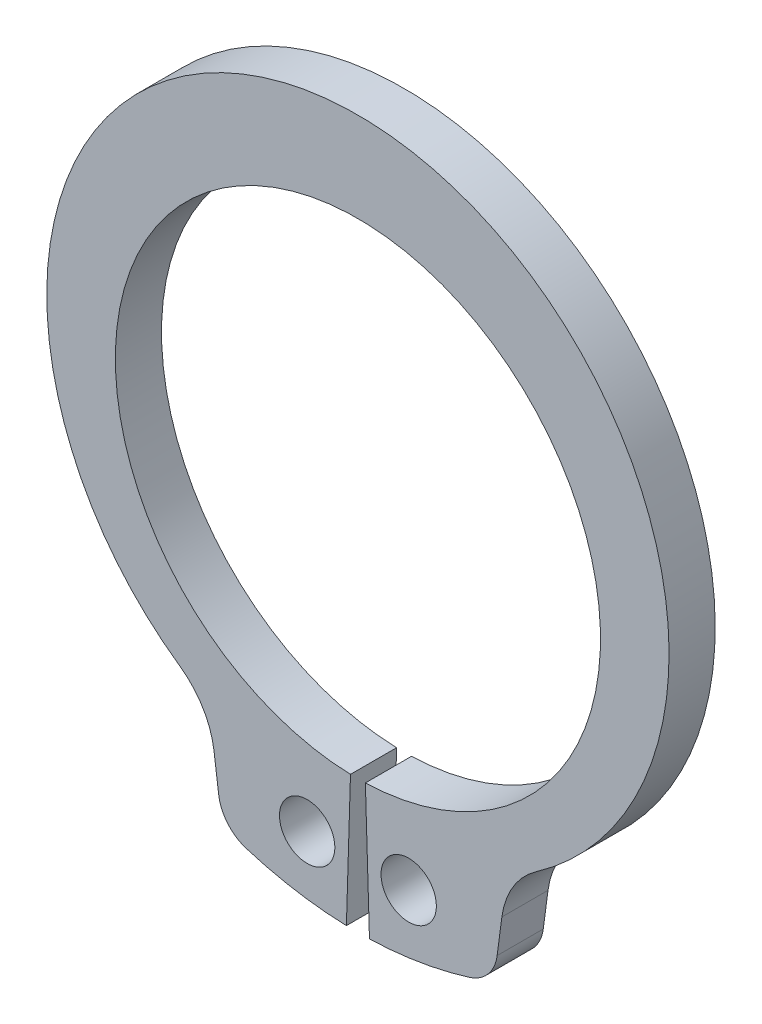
ISO-10303-21;
HEADER;
FILE_DESCRIPTION(('STEP AP214'),'2;1');
FILE_NAME('part.step','',(''),(''),'','','');
FILE_SCHEMA(('AUTOMOTIVE_DESIGN { 1 0 10303 214 1 1 1 1 }'));
ENDSEC;
DATA;
#1=APPLICATION_CONTEXT('core data for automotive mechanical design processes');
#2=APPLICATION_PROTOCOL_DEFINITION('international standard','automotive_design',2000,#1);
#3=PRODUCT_CONTEXT('',#1,'mechanical');
#4=PRODUCT('Part','Part','',(#3));
#5=PRODUCT_RELATED_PRODUCT_CATEGORY('part','',(#4));
#6=PRODUCT_DEFINITION_FORMATION('','',#4);
#7=PRODUCT_DEFINITION_CONTEXT('part definition',#1,'design');
#8=PRODUCT_DEFINITION('design','',#6,#7);
#9=PRODUCT_DEFINITION_SHAPE('','',#8);
#10=(LENGTH_UNIT() NAMED_UNIT(*) SI_UNIT(.MILLI.,.METRE.));
#11=(NAMED_UNIT(*) PLANE_ANGLE_UNIT() SI_UNIT($,.RADIAN.));
#12=(NAMED_UNIT(*) SI_UNIT($,.STERADIAN.) SOLID_ANGLE_UNIT());
#13=UNCERTAINTY_MEASURE_WITH_UNIT(LENGTH_MEASURE(1.E-05),#10,'distance_accuracy_value','');
#14=(GEOMETRIC_REPRESENTATION_CONTEXT(3) GLOBAL_UNCERTAINTY_ASSIGNED_CONTEXT((#13)) GLOBAL_UNIT_ASSIGNED_CONTEXT((#10,
#11,#12)) REPRESENTATION_CONTEXT('',''));
#15=CARTESIAN_POINT('',(0.,0.,0.));
#16=DIRECTION('',(0.,0.,1.));
#17=DIRECTION('',(1.,0.,0.));
#18=AXIS2_PLACEMENT_3D('',#15,#16,#17);
#19=CARTESIAN_POINT('',(0.,0.,-0.889));
#20=DIRECTION('',(0.,0.,1.));
#21=DIRECTION('',(1.,0.,0.));
#22=AXIS2_PLACEMENT_3D('',#19,#20,#21);
#23=CYLINDRICAL_SURFACE('',#22,4.6736);
#24=CARTESIAN_POINT('',(0.,0.,0.));
#25=DIRECTION('',(0.,0.,-1.));
#26=DIRECTION('',(1.,0.,0.));
#27=AXIS2_PLACEMENT_3D('',#24,#25,#26);
#28=CIRCLE('',#27,4.6736);
#29=CARTESIAN_POINT('',(-0.143487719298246,-4.67139681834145,0.));
#30=VERTEX_POINT('',#29);
#31=CARTESIAN_POINT('',(0.143487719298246,-4.67139681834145,0.));
#32=VERTEX_POINT('',#31);
#33=EDGE_CURVE('E159',#30,#32,#28,.T.);
#34=ORIENTED_EDGE('',*,*,#33,.F.);
#35=DIRECTION('',(0.,0.,1.));
#36=VECTOR('',#35,1.);
#37=CARTESIAN_POINT('',(-0.143487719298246,-4.67139681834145,-0.889));
#38=LINE('',#37,#36);
#39=CARTESIAN_POINT('',(-0.143487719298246,-4.67139681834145,-0.889));
#40=VERTEX_POINT('',#39);
#41=EDGE_CURVE('E11',#40,#30,#38,.T.);
#42=ORIENTED_EDGE('',*,*,#41,.F.);
#43=CARTESIAN_POINT('',(0.,0.,-0.889));
#44=DIRECTION('',(0.,0.,-1.));
#45=DIRECTION('',(1.,0.,0.));
#46=AXIS2_PLACEMENT_3D('',#43,#44,#45);
#47=CIRCLE('',#46,4.6736);
#48=CARTESIAN_POINT('',(0.143487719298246,-4.67139681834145,-0.889));
#49=VERTEX_POINT('',#48);
#50=EDGE_CURVE('E194',#40,#49,#47,.T.);
#51=ORIENTED_EDGE('',*,*,#50,.T.);
#52=DIRECTION('',(0.,0.,1.));
#53=VECTOR('',#52,1.);
#54=CARTESIAN_POINT('',(0.143487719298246,-4.67139681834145,-0.889));
#55=LINE('',#54,#53);
#56=EDGE_CURVE('E45',#49,#32,#55,.T.);
#57=ORIENTED_EDGE('',*,*,#56,.T.);
#58=EDGE_LOOP('',(#34,#42,#51,#57));
#59=FACE_BOUND('',#58,.T.);
#60=ADVANCED_FACE('F39',(#59),#23,.F.);
#61=CARTESIAN_POINT('',(-0.143487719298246,-4.67139681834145,-0.889));
#62=DIRECTION('',(0.99952859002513,-0.0307017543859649,0.));
#63=DIRECTION('',(0.0307017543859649,0.99952859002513,0.));
#64=AXIS2_PLACEMENT_3D('',#61,#62,#63);
#65=PLANE('',#64);
#66=DIRECTION('',(0.0307017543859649,0.99952859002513,0.));
#67=VECTOR('',#66,1.);
#68=CARTESIAN_POINT('',(-0.143487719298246,-4.67139681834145,0.));
#69=LINE('',#68,#67);
#70=CARTESIAN_POINT('',(-0.22225,-7.23558746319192,0.));
#71=VERTEX_POINT('',#70);
#72=EDGE_CURVE('E192',#71,#30,#69,.T.);
#73=ORIENTED_EDGE('',*,*,#72,.F.);
#74=DIRECTION('',(0.,0.,1.));
#75=VECTOR('',#74,1.);
#76=CARTESIAN_POINT('',(-0.22225,-7.23558746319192,-0.889));
#77=LINE('',#76,#75);
#78=CARTESIAN_POINT('',(-0.22225,-7.23558746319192,-0.889));
#79=VERTEX_POINT('',#78);
#80=EDGE_CURVE('E48',#79,#71,#77,.T.);
#81=ORIENTED_EDGE('',*,*,#80,.F.);
#82=DIRECTION('',(0.0307017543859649,0.99952859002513,0.));
#83=VECTOR('',#82,1.);
#84=CARTESIAN_POINT('',(-0.143487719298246,-4.67139681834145,-0.889));
#85=LINE('',#84,#83);
#86=EDGE_CURVE('E148',#79,#40,#85,.T.);
#87=ORIENTED_EDGE('',*,*,#86,.T.);
#88=ORIENTED_EDGE('',*,*,#41,.T.);
#89=EDGE_LOOP('',(#73,#81,#87,#88));
#90=FACE_BOUND('',#89,.T.);
#91=ADVANCED_FACE('F214',(#90),#65,.T.);
#92=CARTESIAN_POINT('',(0.,0.,-0.889));
#93=DIRECTION('',(0.,0.,1.));
#94=DIRECTION('',(1.,0.,0.));
#95=AXIS2_PLACEMENT_3D('',#92,#93,#94);
#96=CYLINDRICAL_SURFACE('',#95,7.239);
#97=CARTESIAN_POINT('',(0.,0.,0.));
#98=DIRECTION('',(0.,0.,1.));
#99=DIRECTION('',(1.,0.,0.));
#100=AXIS2_PLACEMENT_3D('',#97,#98,#99);
#101=CIRCLE('',#100,7.239);
#102=CARTESIAN_POINT('',(-2.15332023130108,-6.91131919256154,0.));
#103=VERTEX_POINT('',#102);
#104=EDGE_CURVE('E140',#103,#71,#101,.T.);
#105=ORIENTED_EDGE('',*,*,#104,.F.);
#106=DIRECTION('',(0.,0.,1.));
#107=VECTOR('',#106,1.);
#108=CARTESIAN_POINT('',(-2.15332023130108,-6.91131919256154,-0.889));
#109=LINE('',#108,#107);
#110=CARTESIAN_POINT('',(-2.15332023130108,-6.91131919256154,-0.889));
#111=VERTEX_POINT('',#110);
#112=EDGE_CURVE('E134',#111,#103,#109,.T.);
#113=ORIENTED_EDGE('',*,*,#112,.F.);
#114=CARTESIAN_POINT('',(0.,0.,-0.889));
#115=DIRECTION('',(0.,0.,1.));
#116=DIRECTION('',(1.,0.,0.));
#117=AXIS2_PLACEMENT_3D('',#114,#115,#116);
#118=CIRCLE('',#117,7.239);
#119=EDGE_CURVE('E131',#111,#79,#118,.T.);
#120=ORIENTED_EDGE('',*,*,#119,.T.);
#121=ORIENTED_EDGE('',*,*,#80,.T.);
#122=EDGE_LOOP('',(#105,#113,#120,#121));
#123=FACE_BOUND('',#122,.T.);
#124=ADVANCED_FACE('F135',(#123),#96,.T.);
#125=CARTESIAN_POINT('',(-1.9266549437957,-6.18381190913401,-0.889));
#126=DIRECTION('',(0.,0.,1.));
#127=DIRECTION('',(1.,0.,0.));
#128=AXIS2_PLACEMENT_3D('',#125,#126,#127);
#129=CYLINDRICAL_SURFACE('',#128,0.762000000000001);
#130=CARTESIAN_POINT('',(-1.9266549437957,-6.18381190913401,0.));
#131=DIRECTION('',(0.,0.,1.));
#132=DIRECTION('',(1.,0.,0.));
#133=AXIS2_PLACEMENT_3D('',#130,#131,#132);
#134=CIRCLE('',#133,0.762000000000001);
#135=CARTESIAN_POINT('',(-2.68213592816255,-6.28327286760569,0.));
#136=VERTEX_POINT('',#135);
#137=EDGE_CURVE('E189',#136,#103,#134,.T.);
#138=ORIENTED_EDGE('',*,*,#137,.F.);
#139=DIRECTION('',(0.,0.,1.));
#140=VECTOR('',#139,1.);
#141=CARTESIAN_POINT('',(-2.68213592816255,-6.28327286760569,-0.889));
#142=LINE('',#141,#140);
#143=CARTESIAN_POINT('',(-2.68213592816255,-6.28327286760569,-0.889));
#144=VERTEX_POINT('',#143);
#145=EDGE_CURVE('E145',#144,#136,#142,.T.);
#146=ORIENTED_EDGE('',*,*,#145,.F.);
#147=CARTESIAN_POINT('',(-1.9266549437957,-6.18381190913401,-0.889));
#148=DIRECTION('',(0.,0.,1.));
#149=DIRECTION('',(1.,0.,0.));
#150=AXIS2_PLACEMENT_3D('',#147,#148,#149);
#151=CIRCLE('',#150,0.762000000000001);
#152=EDGE_CURVE('E149',#144,#111,#151,.T.);
#153=ORIENTED_EDGE('',*,*,#152,.T.);
#154=ORIENTED_EDGE('',*,*,#112,.T.);
#155=EDGE_LOOP('',(#138,#146,#153,#154));
#156=FACE_BOUND('',#155,.T.);
#157=ADVANCED_FACE('F154',(#156),#129,.T.);
#158=CARTESIAN_POINT('',(-2.77296439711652,-5.593362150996,-0.889));
#159=DIRECTION('',(-0.99144486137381,-0.130526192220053,0.));
#160=DIRECTION('',(0.130526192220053,-0.99144486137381,0.));
#161=AXIS2_PLACEMENT_3D('',#158,#159,#160);
#162=PLANE('',#161);
#163=DIRECTION('',(0.130526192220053,-0.99144486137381,0.));
#164=VECTOR('',#163,1.);
#165=CARTESIAN_POINT('',(-2.77296439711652,-5.593362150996,0.));
#166=LINE('',#165,#164);
#167=CARTESIAN_POINT('',(-2.77296439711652,-5.593362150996,0.));
#168=VERTEX_POINT('',#167);
#169=EDGE_CURVE('E184',#168,#136,#166,.T.);
#170=ORIENTED_EDGE('',*,*,#169,.F.);
#171=DIRECTION('',(0.,0.,1.));
#172=VECTOR('',#171,1.);
#173=CARTESIAN_POINT('',(-2.77296439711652,-5.593362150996,-0.889));
#174=LINE('',#173,#172);
#175=CARTESIAN_POINT('',(-2.77296439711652,-5.593362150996,-0.889));
#176=VERTEX_POINT('',#175);
#177=EDGE_CURVE('E199',#176,#168,#174,.T.);
#178=ORIENTED_EDGE('',*,*,#177,.F.);
#179=DIRECTION('',(0.130526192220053,-0.99144486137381,0.));
#180=VECTOR('',#179,1.);
#181=CARTESIAN_POINT('',(-2.77296439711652,-5.593362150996,-0.889));
#182=LINE('',#181,#180);
#183=EDGE_CURVE('E152',#176,#144,#182,.T.);
#184=ORIENTED_EDGE('',*,*,#183,.T.);
#185=ORIENTED_EDGE('',*,*,#145,.T.);
#186=EDGE_LOOP('',(#170,#178,#184,#185));
#187=FACE_BOUND('',#186,.T.);
#188=ADVANCED_FACE('F228',(#187),#162,.T.);
#189=CARTESIAN_POINT('',(-4.33327386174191,-5.79878078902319,-0.889));
#190=DIRECTION('',(0.,0.,1.));
#191=DIRECTION('',(1.,0.,0.));
#192=AXIS2_PLACEMENT_3D('',#189,#190,#191);
#193=CYLINDRICAL_SURFACE('',#192,1.57377331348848);
#194=CARTESIAN_POINT('',(-4.33327386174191,-5.79878078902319,0.));
#195=DIRECTION('',(0.,0.,-1.));
#196=DIRECTION('',(1.,0.,0.));
#197=AXIS2_PLACEMENT_3D('',#194,#195,#196);
#198=CIRCLE('',#197,1.57377331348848);
#199=CARTESIAN_POINT('',(-3.43220429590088,-4.50849551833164,0.));
#200=VERTEX_POINT('',#199);
#201=EDGE_CURVE('E185',#200,#168,#198,.T.);
#202=ORIENTED_EDGE('',*,*,#201,.F.);
#203=DIRECTION('',(0.,0.,1.));
#204=VECTOR('',#203,1.);
#205=CARTESIAN_POINT('',(-3.43220429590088,-4.50849551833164,-0.889));
#206=LINE('',#205,#204);
#207=CARTESIAN_POINT('',(-3.43220429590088,-4.50849551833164,-0.889));
#208=VERTEX_POINT('',#207);
#209=EDGE_CURVE('E200',#208,#200,#206,.T.);
#210=ORIENTED_EDGE('',*,*,#209,.F.);
#211=CARTESIAN_POINT('',(-4.33327386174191,-5.79878078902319,-0.889));
#212=DIRECTION('',(0.,0.,-1.));
#213=DIRECTION('',(1.,0.,0.));
#214=AXIS2_PLACEMENT_3D('',#211,#212,#213);
#215=CIRCLE('',#214,1.57377331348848);
#216=EDGE_CURVE('E151',#208,#176,#215,.T.);
#217=ORIENTED_EDGE('',*,*,#216,.T.);
#218=ORIENTED_EDGE('',*,*,#177,.T.);
#219=EDGE_LOOP('',(#202,#210,#217,#218));
#220=FACE_BOUND('',#219,.T.);
#221=ADVANCED_FACE('F230',(#220),#193,.F.);
#222=CARTESIAN_POINT('',(0.,0.406244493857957,-0.889));
#223=DIRECTION('',(0.,0.,1.));
#224=DIRECTION('',(1.,0.,0.));
#225=AXIS2_PLACEMENT_3D('',#222,#223,#224);
#226=CYLINDRICAL_SURFACE('',#225,5.99455550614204);
#227=CARTESIAN_POINT('',(0.,0.406244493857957,0.));
#228=DIRECTION('',(0.,0.,1.));
#229=DIRECTION('',(1.,0.,0.));
#230=AXIS2_PLACEMENT_3D('',#227,#228,#229);
#231=CIRCLE('',#230,5.99455550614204);
#232=CARTESIAN_POINT('',(3.43220429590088,-4.50849551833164,0.));
#233=VERTEX_POINT('',#232);
#234=EDGE_CURVE('E177',#233,#200,#231,.T.);
#235=ORIENTED_EDGE('',*,*,#234,.F.);
#236=DIRECTION('',(0.,0.,1.));
#237=VECTOR('',#236,1.);
#238=CARTESIAN_POINT('',(3.43220429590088,-4.50849551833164,-0.889));
#239=LINE('',#238,#237);
#240=CARTESIAN_POINT('',(3.43220429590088,-4.50849551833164,-0.889));
#241=VERTEX_POINT('',#240);
#242=EDGE_CURVE('E203',#241,#233,#239,.T.);
#243=ORIENTED_EDGE('',*,*,#242,.F.);
#244=CARTESIAN_POINT('',(0.,0.406244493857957,-0.889));
#245=DIRECTION('',(0.,0.,1.));
#246=DIRECTION('',(1.,0.,0.));
#247=AXIS2_PLACEMENT_3D('',#244,#245,#246);
#248=CIRCLE('',#247,5.99455550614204);
#249=EDGE_CURVE('E303',#241,#208,#248,.T.);
#250=ORIENTED_EDGE('',*,*,#249,.T.);
#251=ORIENTED_EDGE('',*,*,#209,.T.);
#252=EDGE_LOOP('',(#235,#243,#250,#251));
#253=FACE_BOUND('',#252,.T.);
#254=ADVANCED_FACE('F231',(#253),#226,.T.);
#255=CARTESIAN_POINT('',(4.33327386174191,-5.79878078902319,-0.889));
#256=DIRECTION('',(0.,0.,1.));
#257=DIRECTION('',(1.,0.,0.));
#258=AXIS2_PLACEMENT_3D('',#255,#256,#257);
#259=CYLINDRICAL_SURFACE('',#258,1.57377331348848);
#260=CARTESIAN_POINT('',(4.33327386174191,-5.79878078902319,0.));
#261=DIRECTION('',(0.,0.,-1.));
#262=DIRECTION('',(1.,0.,0.));
#263=AXIS2_PLACEMENT_3D('',#260,#261,#262);
#264=CIRCLE('',#263,1.57377331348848);
#265=CARTESIAN_POINT('',(2.77296439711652,-5.593362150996,0.));
#266=VERTEX_POINT('',#265);
#267=EDGE_CURVE('E176',#266,#233,#264,.T.);
#268=ORIENTED_EDGE('',*,*,#267,.F.);
#269=DIRECTION('',(0.,0.,1.));
#270=VECTOR('',#269,1.);
#271=CARTESIAN_POINT('',(2.77296439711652,-5.593362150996,-0.889));
#272=LINE('',#271,#270);
#273=CARTESIAN_POINT('',(2.77296439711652,-5.593362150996,-0.889));
#274=VERTEX_POINT('',#273);
#275=EDGE_CURVE('E201',#274,#266,#272,.T.);
#276=ORIENTED_EDGE('',*,*,#275,.F.);
#277=CARTESIAN_POINT('',(4.33327386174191,-5.79878078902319,-0.889));
#278=DIRECTION('',(0.,0.,-1.));
#279=DIRECTION('',(1.,0.,0.));
#280=AXIS2_PLACEMENT_3D('',#277,#278,#279);
#281=CIRCLE('',#280,1.57377331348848);
#282=EDGE_CURVE('E297',#274,#241,#281,.T.);
#283=ORIENTED_EDGE('',*,*,#282,.T.);
#284=ORIENTED_EDGE('',*,*,#242,.T.);
#285=EDGE_LOOP('',(#268,#276,#283,#284));
#286=FACE_BOUND('',#285,.T.);
#287=ADVANCED_FACE('F240',(#286),#259,.F.);
#288=CARTESIAN_POINT('',(2.77296439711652,-5.593362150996,-0.889));
#289=DIRECTION('',(0.99144486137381,-0.130526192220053,0.));
#290=DIRECTION('',(0.130526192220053,0.99144486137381,0.));
#291=AXIS2_PLACEMENT_3D('',#288,#289,#290);
#292=PLANE('',#291);
#293=DIRECTION('',(0.130526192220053,0.99144486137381,0.));
#294=VECTOR('',#293,1.);
#295=CARTESIAN_POINT('',(2.77296439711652,-5.593362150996,0.));
#296=LINE('',#295,#294);
#297=CARTESIAN_POINT('',(2.68213592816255,-6.28327286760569,0.));
#298=VERTEX_POINT('',#297);
#299=EDGE_CURVE('E173',#298,#266,#296,.T.);
#300=ORIENTED_EDGE('',*,*,#299,.F.);
#301=DIRECTION('',(0.,0.,1.));
#302=VECTOR('',#301,1.);
#303=CARTESIAN_POINT('',(2.68213592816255,-6.28327286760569,-0.889));
#304=LINE('',#303,#302);
#305=CARTESIAN_POINT('',(2.68213592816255,-6.28327286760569,-0.889));
#306=VERTEX_POINT('',#305);
#307=EDGE_CURVE('E204',#306,#298,#304,.T.);
#308=ORIENTED_EDGE('',*,*,#307,.F.);
#309=DIRECTION('',(0.130526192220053,0.99144486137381,0.));
#310=VECTOR('',#309,1.);
#311=CARTESIAN_POINT('',(2.77296439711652,-5.593362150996,-0.889));
#312=LINE('',#311,#310);
#313=EDGE_CURVE('E300',#306,#274,#312,.T.);
#314=ORIENTED_EDGE('',*,*,#313,.T.);
#315=ORIENTED_EDGE('',*,*,#275,.T.);
#316=EDGE_LOOP('',(#300,#308,#314,#315));
#317=FACE_BOUND('',#316,.T.);
#318=ADVANCED_FACE('F241',(#317),#292,.T.);
#319=CARTESIAN_POINT('',(1.9266549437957,-6.18381190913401,-0.889));
#320=DIRECTION('',(0.,0.,1.));
#321=DIRECTION('',(1.,0.,0.));
#322=AXIS2_PLACEMENT_3D('',#319,#320,#321);
#323=CYLINDRICAL_SURFACE('',#322,0.762000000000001);
#324=CARTESIAN_POINT('',(1.9266549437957,-6.18381190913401,0.));
#325=DIRECTION('',(0.,0.,1.));
#326=DIRECTION('',(-1.,0.,0.));
#327=AXIS2_PLACEMENT_3D('',#324,#325,#326);
#328=CIRCLE('',#327,0.762000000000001);
#329=CARTESIAN_POINT('',(2.15332023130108,-6.91131919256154,0.));
#330=VERTEX_POINT('',#329);
#331=EDGE_CURVE('E167',#330,#298,#328,.T.);
#332=ORIENTED_EDGE('',*,*,#331,.F.);
#333=DIRECTION('',(0.,0.,1.));
#334=VECTOR('',#333,1.);
#335=CARTESIAN_POINT('',(2.15332023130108,-6.91131919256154,-0.889));
#336=LINE('',#335,#334);
#337=CARTESIAN_POINT('',(2.15332023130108,-6.91131919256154,-0.889));
#338=VERTEX_POINT('',#337);
#339=EDGE_CURVE('E210',#338,#330,#336,.T.);
#340=ORIENTED_EDGE('',*,*,#339,.F.);
#341=CARTESIAN_POINT('',(1.9266549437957,-6.18381190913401,-0.889));
#342=DIRECTION('',(0.,0.,1.));
#343=DIRECTION('',(-1.,0.,0.));
#344=AXIS2_PLACEMENT_3D('',#341,#342,#343);
#345=CIRCLE('',#344,0.762000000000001);
#346=EDGE_CURVE('E295',#338,#306,#345,.T.);
#347=ORIENTED_EDGE('',*,*,#346,.T.);
#348=ORIENTED_EDGE('',*,*,#307,.T.);
#349=EDGE_LOOP('',(#332,#340,#347,#348));
#350=FACE_BOUND('',#349,.T.);
#351=ADVANCED_FACE('F244',(#350),#323,.T.);
#352=CARTESIAN_POINT('',(0.,0.,-0.889));
#353=DIRECTION('',(0.,0.,1.));
#354=DIRECTION('',(1.,0.,0.));
#355=AXIS2_PLACEMENT_3D('',#352,#353,#354);
#356=CYLINDRICAL_SURFACE('',#355,7.239);
#357=CARTESIAN_POINT('',(0.,0.,0.));
#358=DIRECTION('',(0.,0.,1.));
#359=DIRECTION('',(1.,0.,0.));
#360=AXIS2_PLACEMENT_3D('',#357,#358,#359);
#361=CIRCLE('',#360,7.239);
#362=CARTESIAN_POINT('',(0.222249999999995,-7.23558746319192,0.));
#363=VERTEX_POINT('',#362);
#364=EDGE_CURVE('E170',#363,#330,#361,.T.);
#365=ORIENTED_EDGE('',*,*,#364,.F.);
#366=DIRECTION('',(0.,0.,1.));
#367=VECTOR('',#366,1.);
#368=CARTESIAN_POINT('',(0.222249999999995,-7.23558746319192,-0.889));
#369=LINE('',#368,#367);
#370=CARTESIAN_POINT('',(0.222249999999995,-7.23558746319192,-0.889));
#371=VERTEX_POINT('',#370);
#372=EDGE_CURVE('E206',#371,#363,#369,.T.);
#373=ORIENTED_EDGE('',*,*,#372,.F.);
#374=CARTESIAN_POINT('',(0.,0.,-0.889));
#375=DIRECTION('',(0.,0.,1.));
#376=DIRECTION('',(1.,0.,0.));
#377=AXIS2_PLACEMENT_3D('',#374,#375,#376);
#378=CIRCLE('',#377,7.239);
#379=EDGE_CURVE('E293',#371,#338,#378,.T.);
#380=ORIENTED_EDGE('',*,*,#379,.T.);
#381=ORIENTED_EDGE('',*,*,#339,.T.);
#382=EDGE_LOOP('',(#365,#373,#380,#381));
#383=FACE_BOUND('',#382,.T.);
#384=ADVANCED_FACE('F248',(#383),#356,.T.);
#385=CARTESIAN_POINT('',(0.143487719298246,-4.67139681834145,-0.889));
#386=DIRECTION('',(-0.99952859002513,-0.0307017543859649,0.));
#387=DIRECTION('',(0.0307017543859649,-0.99952859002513,0.));
#388=AXIS2_PLACEMENT_3D('',#385,#386,#387);
#389=PLANE('',#388);
#390=DIRECTION('',(0.0307017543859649,-0.99952859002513,0.));
#391=VECTOR('',#390,1.);
#392=CARTESIAN_POINT('',(0.143487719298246,-4.67139681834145,0.));
#393=LINE('',#392,#391);
#394=EDGE_CURVE('E161',#32,#363,#393,.T.);
#395=ORIENTED_EDGE('',*,*,#394,.F.);
#396=ORIENTED_EDGE('',*,*,#56,.F.);
#397=DIRECTION('',(0.0307017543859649,-0.99952859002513,0.));
#398=VECTOR('',#397,1.);
#399=CARTESIAN_POINT('',(0.143487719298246,-4.67139681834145,-0.889));
#400=LINE('',#399,#398);
#401=EDGE_CURVE('E287',#49,#371,#400,.T.);
#402=ORIENTED_EDGE('',*,*,#401,.T.);
#403=ORIENTED_EDGE('',*,*,#372,.T.);
#404=EDGE_LOOP('',(#395,#396,#402,#403));
#405=FACE_BOUND('',#404,.T.);
#406=ADVANCED_FACE('F208',(#405),#389,.T.);
#407=CARTESIAN_POINT('',(0.,0.,-0.889));
#408=DIRECTION('',(0.,0.,1.));
#409=DIRECTION('',(1.,0.,0.));
#410=AXIS2_PLACEMENT_3D('',#407,#408,#409);
#411=PLANE('',#410);
#412=CARTESIAN_POINT('',(-0.9779,-6.04278491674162,-0.889));
#413=DIRECTION('',(0.,0.,1.));
#414=DIRECTION('',(1.,0.,0.));
#415=AXIS2_PLACEMENT_3D('',#412,#413,#414);
#416=CIRCLE('',#415,0.5334);
#417=CARTESIAN_POINT('',(-0.4445,-6.04278491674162,-0.889));
#418=VERTEX_POINT('',#417);
#419=EDGE_CURVE('E277',#418,#418,#416,.T.);
#420=ORIENTED_EDGE('',*,*,#419,.T.);
#421=EDGE_LOOP('',(#420));
#422=FACE_BOUND('',#421,.T.);
#423=CARTESIAN_POINT('',(0.9779,-6.04278491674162,-0.889));
#424=DIRECTION('',(0.,0.,1.));
#425=DIRECTION('',(1.,0.,0.));
#426=AXIS2_PLACEMENT_3D('',#423,#424,#425);
#427=CIRCLE('',#426,0.5334);
#428=CARTESIAN_POINT('',(1.5113,-6.04278491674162,-0.889));
#429=VERTEX_POINT('',#428);
#430=EDGE_CURVE('E165',#429,#429,#427,.T.);
#431=ORIENTED_EDGE('',*,*,#430,.T.);
#432=EDGE_LOOP('',(#431));
#433=FACE_BOUND('',#432,.T.);
#434=ORIENTED_EDGE('',*,*,#50,.F.);
#435=ORIENTED_EDGE('',*,*,#86,.F.);
#436=ORIENTED_EDGE('',*,*,#119,.F.);
#437=ORIENTED_EDGE('',*,*,#152,.F.);
#438=ORIENTED_EDGE('',*,*,#183,.F.);
#439=ORIENTED_EDGE('',*,*,#216,.F.);
#440=ORIENTED_EDGE('',*,*,#249,.F.);
#441=ORIENTED_EDGE('',*,*,#282,.F.);
#442=ORIENTED_EDGE('',*,*,#313,.F.);
#443=ORIENTED_EDGE('',*,*,#346,.F.);
#444=ORIENTED_EDGE('',*,*,#379,.F.);
#445=ORIENTED_EDGE('',*,*,#401,.F.);
#446=EDGE_LOOP('',(#434,#435,#436,#437,#438,#439,#440,#441,#442,#443,#444,#445));
#447=FACE_BOUND('',#446,.T.);
#448=ADVANCED_FACE('F147',(#422,#433,#447),#411,.F.);
#449=CARTESIAN_POINT('',(0.,0.,0.));
#450=DIRECTION('',(0.,0.,1.));
#451=DIRECTION('',(1.,0.,0.));
#452=AXIS2_PLACEMENT_3D('',#449,#450,#451);
#453=PLANE('',#452);
#454=CARTESIAN_POINT('',(-0.9779,-6.04278491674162,0.));
#455=DIRECTION('',(0.,0.,1.));
#456=DIRECTION('',(1.,0.,0.));
#457=AXIS2_PLACEMENT_3D('',#454,#455,#456);
#458=CIRCLE('',#457,0.5334);
#459=CARTESIAN_POINT('',(-0.4445,-6.04278491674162,0.));
#460=VERTEX_POINT('',#459);
#461=EDGE_CURVE('E276',#460,#460,#458,.T.);
#462=ORIENTED_EDGE('',*,*,#461,.F.);
#463=EDGE_LOOP('',(#462));
#464=FACE_BOUND('',#463,.T.);
#465=CARTESIAN_POINT('',(0.9779,-6.04278491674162,0.));
#466=DIRECTION('',(0.,0.,1.));
#467=DIRECTION('',(1.,0.,0.));
#468=AXIS2_PLACEMENT_3D('',#465,#466,#467);
#469=CIRCLE('',#468,0.5334);
#470=CARTESIAN_POINT('',(1.5113,-6.04278491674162,0.));
#471=VERTEX_POINT('',#470);
#472=EDGE_CURVE('E283',#471,#471,#469,.T.);
#473=ORIENTED_EDGE('',*,*,#472,.F.);
#474=EDGE_LOOP('',(#473));
#475=FACE_BOUND('',#474,.T.);
#476=ORIENTED_EDGE('',*,*,#33,.T.);
#477=ORIENTED_EDGE('',*,*,#394,.T.);
#478=ORIENTED_EDGE('',*,*,#364,.T.);
#479=ORIENTED_EDGE('',*,*,#331,.T.);
#480=ORIENTED_EDGE('',*,*,#299,.T.);
#481=ORIENTED_EDGE('',*,*,#267,.T.);
#482=ORIENTED_EDGE('',*,*,#234,.T.);
#483=ORIENTED_EDGE('',*,*,#201,.T.);
#484=ORIENTED_EDGE('',*,*,#169,.T.);
#485=ORIENTED_EDGE('',*,*,#137,.T.);
#486=ORIENTED_EDGE('',*,*,#104,.T.);
#487=ORIENTED_EDGE('',*,*,#72,.T.);
#488=EDGE_LOOP('',(#476,#477,#478,#479,#480,#481,#482,#483,#484,#485,#486,#487));
#489=FACE_BOUND('',#488,.T.);
#490=ADVANCED_FACE('F215',(#464,#475,#489),#453,.T.);
#491=CARTESIAN_POINT('',(0.9779,-6.04278491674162,-0.889));
#492=DIRECTION('',(0.,0.,1.));
#493=DIRECTION('',(1.,0.,0.));
#494=AXIS2_PLACEMENT_3D('',#491,#492,#493);
#495=CYLINDRICAL_SURFACE('',#494,0.5334);
#496=ORIENTED_EDGE('',*,*,#430,.F.);
#497=EDGE_LOOP('',(#496));
#498=FACE_BOUND('',#497,.T.);
#499=ORIENTED_EDGE('',*,*,#472,.T.);
#500=EDGE_LOOP('',(#499));
#501=FACE_BOUND('',#500,.T.);
#502=ADVANCED_FACE('F263',(#498,#501),#495,.F.);
#503=CARTESIAN_POINT('',(-0.9779,-6.04278491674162,-0.889));
#504=DIRECTION('',(0.,0.,1.));
#505=DIRECTION('',(1.,0.,0.));
#506=AXIS2_PLACEMENT_3D('',#503,#504,#505);
#507=CYLINDRICAL_SURFACE('',#506,0.5334);
#508=ORIENTED_EDGE('',*,*,#419,.F.);
#509=EDGE_LOOP('',(#508));
#510=FACE_BOUND('',#509,.T.);
#511=ORIENTED_EDGE('',*,*,#461,.T.);
#512=EDGE_LOOP('',(#511));
#513=FACE_BOUND('',#512,.T.);
#514=ADVANCED_FACE('F266',(#510,#513),#507,.F.);
#515=CLOSED_SHELL('',(#60,#91,#124,#157,#188,#221,#254,#287,#318,#351,#384,#406,#448,#490,#502,#514));
#516=MANIFOLD_SOLID_BREP('B2',#515);
#517=ADVANCED_BREP_SHAPE_REPRESENTATION('',(#18,#516),#14);
#518=SHAPE_DEFINITION_REPRESENTATION(#9,#517);
ENDSEC;
END-ISO-10303-21;
